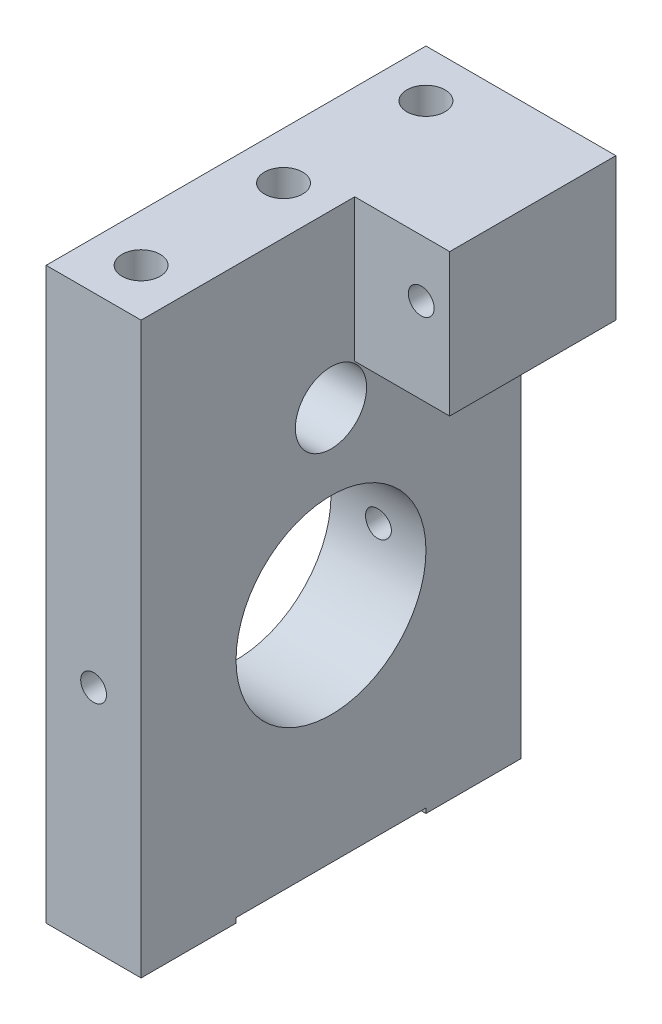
ISO-10303-21;
HEADER;
FILE_DESCRIPTION(('STEP AP214'),'2;1');
FILE_NAME('part.step','',(''),(''),'','','');
FILE_SCHEMA(('AUTOMOTIVE_DESIGN { 1 0 10303 214 1 1 1 1 }'));
ENDSEC;
DATA;
#1=APPLICATION_CONTEXT('core data for automotive mechanical design processes');
#2=APPLICATION_PROTOCOL_DEFINITION('international standard','automotive_design',2000,#1);
#3=PRODUCT_CONTEXT('',#1,'mechanical');
#4=PRODUCT('Part','Part','',(#3));
#5=PRODUCT_RELATED_PRODUCT_CATEGORY('part','',(#4));
#6=PRODUCT_DEFINITION_FORMATION('','',#4);
#7=PRODUCT_DEFINITION_CONTEXT('part definition',#1,'design');
#8=PRODUCT_DEFINITION('design','',#6,#7);
#9=PRODUCT_DEFINITION_SHAPE('','',#8);
#10=(LENGTH_UNIT() NAMED_UNIT(*) SI_UNIT(.MILLI.,.METRE.));
#11=(NAMED_UNIT(*) PLANE_ANGLE_UNIT() SI_UNIT($,.RADIAN.));
#12=(NAMED_UNIT(*) SI_UNIT($,.STERADIAN.) SOLID_ANGLE_UNIT());
#13=UNCERTAINTY_MEASURE_WITH_UNIT(LENGTH_MEASURE(1.E-05),#10,'distance_accuracy_value','');
#14=(GEOMETRIC_REPRESENTATION_CONTEXT(3) GLOBAL_UNCERTAINTY_ASSIGNED_CONTEXT((#13)) GLOBAL_UNIT_ASSIGNED_CONTEXT((#10,
#11,#12)) REPRESENTATION_CONTEXT('',''));
#15=CARTESIAN_POINT('',(0.,0.,0.));
#16=DIRECTION('',(0.,0.,1.));
#17=DIRECTION('',(1.,0.,0.));
#18=AXIS2_PLACEMENT_3D('',#15,#16,#17);
#19=CARTESIAN_POINT('',(6.35,-38.1,25.4));
#20=DIRECTION('',(0.,1.,0.));
#21=DIRECTION('',(0.,0.,1.));
#22=AXIS2_PLACEMENT_3D('',#19,#20,#21);
#23=PLANE('',#22);
#24=CARTESIAN_POINT('',(0.,-38.1,19.05));
#25=DIRECTION('',(0.,-1.,0.));
#26=DIRECTION('',(0.,0.,-1.));
#27=AXIS2_PLACEMENT_3D('',#24,#25,#26);
#28=CIRCLE('',#27,2.5527);
#29=CARTESIAN_POINT('',(0.,-38.1,16.4973));
#30=VERTEX_POINT('',#29);
#31=EDGE_CURVE('E180',#30,#30,#28,.T.);
#32=ORIENTED_EDGE('',*,*,#31,.F.);
#33=EDGE_LOOP('',(#32));
#34=FACE_BOUND('',#33,.T.);
#35=DIRECTION('',(0.,0.,-1.));
#36=VECTOR('',#35,1.);
#37=CARTESIAN_POINT('',(-6.35,-38.1,25.4));
#38=LINE('',#37,#36);
#39=CARTESIAN_POINT('',(-6.35,-38.1,25.4));
#40=VERTEX_POINT('',#39);
#41=CARTESIAN_POINT('',(-6.35,-38.1,12.7));
#42=VERTEX_POINT('',#41);
#43=EDGE_CURVE('E340',#40,#42,#38,.T.);
#44=ORIENTED_EDGE('',*,*,#43,.T.);
#45=DIRECTION('',(1.,0.,0.));
#46=VECTOR('',#45,1.);
#47=CARTESIAN_POINT('',(-6.351,-38.1,12.7));
#48=LINE('',#47,#46);
#49=CARTESIAN_POINT('',(6.35,-38.1,12.7));
#50=VERTEX_POINT('',#49);
#51=EDGE_CURVE('E177',#42,#50,#48,.T.);
#52=ORIENTED_EDGE('',*,*,#51,.T.);
#53=DIRECTION('',(0.,0.,-1.));
#54=VECTOR('',#53,1.);
#55=CARTESIAN_POINT('',(6.35,-38.1,25.4));
#56=LINE('',#55,#54);
#57=CARTESIAN_POINT('',(6.35,-38.1,25.4));
#58=VERTEX_POINT('',#57);
#59=EDGE_CURVE('E290',#58,#50,#56,.T.);
#60=ORIENTED_EDGE('',*,*,#59,.F.);
#61=DIRECTION('',(-1.,0.,0.));
#62=VECTOR('',#61,1.);
#63=CARTESIAN_POINT('',(6.35,-38.1,25.4));
#64=LINE('',#63,#62);
#65=EDGE_CURVE('E11',#58,#40,#64,.T.);
#66=ORIENTED_EDGE('',*,*,#65,.T.);
#67=EDGE_LOOP('',(#44,#52,#60,#66));
#68=FACE_BOUND('',#67,.T.);
#69=ADVANCED_FACE('F38',(#34,#68),#23,.F.);
#70=CARTESIAN_POINT('',(6.35,38.1,25.4));
#71=DIRECTION('',(0.,0.,-1.));
#72=DIRECTION('',(0.,1.,0.));
#73=AXIS2_PLACEMENT_3D('',#70,#71,#72);
#74=PLANE('',#73);
#75=CARTESIAN_POINT('',(0.,-7.62000000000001,25.4));
#76=DIRECTION('',(0.,0.,1.));
#77=DIRECTION('',(1.,0.,0.));
#78=AXIS2_PLACEMENT_3D('',#75,#76,#77);
#79=CIRCLE('',#78,1.72719999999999);
#80=CARTESIAN_POINT('',(1.72719999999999,-7.62000000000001,25.4));
#81=VERTEX_POINT('',#80);
#82=EDGE_CURVE('E609',#81,#81,#79,.T.);
#83=ORIENTED_EDGE('',*,*,#82,.F.);
#84=EDGE_LOOP('',(#83));
#85=FACE_BOUND('',#84,.T.);
#86=DIRECTION('',(0.,-1.,0.));
#87=VECTOR('',#86,1.);
#88=CARTESIAN_POINT('',(-6.35,38.1,25.4));
#89=LINE('',#88,#87);
#90=CARTESIAN_POINT('',(-6.35,38.1,25.4));
#91=VERTEX_POINT('',#90);
#92=EDGE_CURVE('E312',#91,#40,#89,.T.);
#93=ORIENTED_EDGE('',*,*,#92,.T.);
#94=ORIENTED_EDGE('',*,*,#65,.F.);
#95=DIRECTION('',(0.,-1.,0.));
#96=VECTOR('',#95,1.);
#97=CARTESIAN_POINT('',(6.35,38.1,25.4));
#98=LINE('',#97,#96);
#99=CARTESIAN_POINT('',(6.35,38.1,25.4));
#100=VERTEX_POINT('',#99);
#101=EDGE_CURVE('E291',#100,#58,#98,.T.);
#102=ORIENTED_EDGE('',*,*,#101,.F.);
#103=DIRECTION('',(-1.,0.,0.));
#104=VECTOR('',#103,1.);
#105=CARTESIAN_POINT('',(6.35,38.1,25.4));
#106=LINE('',#105,#104);
#107=EDGE_CURVE('E307',#100,#91,#106,.T.);
#108=ORIENTED_EDGE('',*,*,#107,.T.);
#109=EDGE_LOOP('',(#93,#94,#102,#108));
#110=FACE_BOUND('',#109,.T.);
#111=ADVANCED_FACE('F40',(#85,#110),#74,.F.);
#112=CARTESIAN_POINT('',(0.,-38.1,-19.05));
#113=DIRECTION('',(0.,-1.,0.));
#114=DIRECTION('',(0.,0.,-1.));
#115=AXIS2_PLACEMENT_3D('',#112,#113,#114);
#116=CIRCLE('',#115,2.5527);
#117=CARTESIAN_POINT('',(0.,-38.1,-21.6027));
#118=VERTEX_POINT('',#117);
#119=EDGE_CURVE('E192',#118,#118,#116,.T.);
#120=ORIENTED_EDGE('',*,*,#119,.F.);
#121=EDGE_LOOP('',(#120));
#122=FACE_BOUND('',#121,.T.);
#123=CARTESIAN_POINT('',(6.35,-38.1,-12.7));
#124=VERTEX_POINT('',#123);
#125=CARTESIAN_POINT('',(6.35,-38.1,-25.4));
#126=VERTEX_POINT('',#125);
#127=EDGE_CURVE('E285',#124,#126,#56,.T.);
#128=ORIENTED_EDGE('',*,*,#127,.F.);
#129=DIRECTION('',(1.,0.,0.));
#130=VECTOR('',#129,1.);
#131=CARTESIAN_POINT('',(-6.351,-38.1,-12.7));
#132=LINE('',#131,#130);
#133=CARTESIAN_POINT('',(-6.35,-38.1,-12.7));
#134=VERTEX_POINT('',#133);
#135=EDGE_CURVE('E183',#134,#124,#132,.T.);
#136=ORIENTED_EDGE('',*,*,#135,.F.);
#137=CARTESIAN_POINT('',(-6.35,-38.1,-25.4));
#138=VERTEX_POINT('',#137);
#139=EDGE_CURVE('E317',#134,#138,#38,.T.);
#140=ORIENTED_EDGE('',*,*,#139,.T.);
#141=DIRECTION('',(-1.,0.,0.));
#142=VECTOR('',#141,1.);
#143=CARTESIAN_POINT('',(6.35,-38.1,-25.4));
#144=LINE('',#143,#142);
#145=EDGE_CURVE('E51',#126,#138,#144,.T.);
#146=ORIENTED_EDGE('',*,*,#145,.F.);
#147=EDGE_LOOP('',(#128,#136,#140,#146));
#148=FACE_BOUND('',#147,.T.);
#149=ADVANCED_FACE('F264',(#122,#148),#23,.F.);
#150=CARTESIAN_POINT('',(6.35,38.1,-25.4));
#151=DIRECTION('',(0.,0.,1.));
#152=DIRECTION('',(0.,-1.,0.));
#153=AXIS2_PLACEMENT_3D('',#150,#151,#152);
#154=PLANE('',#153);
#155=CARTESIAN_POINT('',(0.,-7.62000000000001,-25.4));
#156=DIRECTION('',(0.,0.,1.));
#157=DIRECTION('',(0.,-1.,0.));
#158=AXIS2_PLACEMENT_3D('',#155,#156,#157);
#159=CIRCLE('',#158,1.72719999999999);
#160=CARTESIAN_POINT('',(0.,-9.3472,-25.4));
#161=VERTEX_POINT('',#160);
#162=EDGE_CURVE('E604',#161,#161,#159,.T.);
#163=ORIENTED_EDGE('',*,*,#162,.T.);
#164=EDGE_LOOP('',(#163));
#165=FACE_BOUND('',#164,.T.);
#166=CARTESIAN_POINT('',(15.24,30.48,-25.4));
#167=DIRECTION('',(0.,0.,1.));
#168=DIRECTION('',(0.,-1.,0.));
#169=AXIS2_PLACEMENT_3D('',#166,#167,#168);
#170=CIRCLE('',#169,1.72719999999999);
#171=CARTESIAN_POINT('',(15.24,28.7528,-25.4));
#172=VERTEX_POINT('',#171);
#173=EDGE_CURVE('E223',#172,#172,#170,.T.);
#174=ORIENTED_EDGE('',*,*,#173,.T.);
#175=EDGE_LOOP('',(#174));
#176=FACE_BOUND('',#175,.T.);
#177=DIRECTION('',(0.,1.,0.));
#178=VECTOR('',#177,1.);
#179=CARTESIAN_POINT('',(-6.35,38.1,-25.4));
#180=LINE('',#179,#178);
#181=CARTESIAN_POINT('',(-6.35,38.1,-25.4));
#182=VERTEX_POINT('',#181);
#183=EDGE_CURVE('E628',#138,#182,#180,.T.);
#184=ORIENTED_EDGE('',*,*,#183,.T.);
#185=DIRECTION('',(-1.,0.,0.));
#186=VECTOR('',#185,1.);
#187=CARTESIAN_POINT('',(6.35,38.1,-25.4));
#188=LINE('',#187,#186);
#189=CARTESIAN_POINT('',(19.05,38.1,-25.4));
#190=VERTEX_POINT('',#189);
#191=EDGE_CURVE('E629',#190,#182,#188,.T.);
#192=ORIENTED_EDGE('',*,*,#191,.F.);
#193=DIRECTION('',(0.,1.,0.));
#194=VECTOR('',#193,1.);
#195=CARTESIAN_POINT('',(19.05,38.1,-25.4));
#196=LINE('',#195,#194);
#197=CARTESIAN_POINT('',(19.05,19.05,-25.4));
#198=VERTEX_POINT('',#197);
#199=EDGE_CURVE('E198',#198,#190,#196,.T.);
#200=ORIENTED_EDGE('',*,*,#199,.F.);
#201=DIRECTION('',(-1.,0.,0.));
#202=VECTOR('',#201,1.);
#203=CARTESIAN_POINT('',(19.05,19.05,-25.4));
#204=LINE('',#203,#202);
#205=CARTESIAN_POINT('',(6.35,19.05,-25.4));
#206=VERTEX_POINT('',#205);
#207=EDGE_CURVE('E208',#198,#206,#204,.T.);
#208=ORIENTED_EDGE('',*,*,#207,.T.);
#209=DIRECTION('',(0.,1.,0.));
#210=VECTOR('',#209,1.);
#211=CARTESIAN_POINT('',(6.35,38.1,-25.4));
#212=LINE('',#211,#210);
#213=EDGE_CURVE('E294',#126,#206,#212,.T.);
#214=ORIENTED_EDGE('',*,*,#213,.F.);
#215=ORIENTED_EDGE('',*,*,#145,.T.);
#216=EDGE_LOOP('',(#184,#192,#200,#208,#214,#215));
#217=FACE_BOUND('',#216,.T.);
#218=ADVANCED_FACE('F273',(#165,#176,#217),#154,.F.);
#219=CARTESIAN_POINT('',(6.35,38.1,25.4));
#220=DIRECTION('',(0.,-1.,0.));
#221=DIRECTION('',(0.,0.,-1.));
#222=AXIS2_PLACEMENT_3D('',#219,#220,#221);
#223=PLANE('',#222);
#224=CARTESIAN_POINT('',(0.,38.1,-19.05));
#225=DIRECTION('',(0.,1.,0.));
#226=DIRECTION('',(0.,0.,1.));
#227=AXIS2_PLACEMENT_3D('',#224,#225,#226);
#228=CIRCLE('',#227,2.55269999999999);
#229=CARTESIAN_POINT('',(0.,38.1,-16.4973));
#230=VERTEX_POINT('',#229);
#231=EDGE_CURVE('E148',#230,#230,#228,.T.);
#232=ORIENTED_EDGE('',*,*,#231,.F.);
#233=EDGE_LOOP('',(#232));
#234=FACE_BOUND('',#233,.T.);
#235=CARTESIAN_POINT('',(0.,38.1,0.));
#236=DIRECTION('',(0.,1.,0.));
#237=DIRECTION('',(0.,0.,1.));
#238=AXIS2_PLACEMENT_3D('',#235,#236,#237);
#239=CIRCLE('',#238,2.55269999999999);
#240=CARTESIAN_POINT('',(0.,38.1,2.55269999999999));
#241=VERTEX_POINT('',#240);
#242=EDGE_CURVE('E147',#241,#241,#239,.T.);
#243=ORIENTED_EDGE('',*,*,#242,.F.);
#244=EDGE_LOOP('',(#243));
#245=FACE_BOUND('',#244,.T.);
#246=CARTESIAN_POINT('',(0.,38.1,19.05));
#247=DIRECTION('',(0.,1.,0.));
#248=DIRECTION('',(0.,0.,1.));
#249=AXIS2_PLACEMENT_3D('',#246,#247,#248);
#250=CIRCLE('',#249,2.55269999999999);
#251=CARTESIAN_POINT('',(0.,38.1,21.6027));
#252=VERTEX_POINT('',#251);
#253=EDGE_CURVE('E151',#252,#252,#250,.T.);
#254=ORIENTED_EDGE('',*,*,#253,.F.);
#255=EDGE_LOOP('',(#254));
#256=FACE_BOUND('',#255,.T.);
#257=DIRECTION('',(0.,0.,1.));
#258=VECTOR('',#257,1.);
#259=CARTESIAN_POINT('',(-6.35,38.1,25.4));
#260=LINE('',#259,#258);
#261=EDGE_CURVE('E296',#182,#91,#260,.T.);
#262=ORIENTED_EDGE('',*,*,#261,.T.);
#263=ORIENTED_EDGE('',*,*,#107,.F.);
#264=DIRECTION('',(0.,0.,1.));
#265=VECTOR('',#264,1.);
#266=CARTESIAN_POINT('',(6.35,38.1,25.4));
#267=LINE('',#266,#265);
#268=CARTESIAN_POINT('',(6.35,38.1,-3.17499999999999));
#269=VERTEX_POINT('',#268);
#270=EDGE_CURVE('E304',#269,#100,#267,.T.);
#271=ORIENTED_EDGE('',*,*,#270,.F.);
#272=DIRECTION('',(-1.,0.,0.));
#273=VECTOR('',#272,1.);
#274=CARTESIAN_POINT('',(19.05,38.1,-3.17499999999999));
#275=LINE('',#274,#273);
#276=CARTESIAN_POINT('',(19.05,38.1,-3.17499999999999));
#277=VERTEX_POINT('',#276);
#278=EDGE_CURVE('E310',#277,#269,#275,.T.);
#279=ORIENTED_EDGE('',*,*,#278,.F.);
#280=DIRECTION('',(0.,0.,1.));
#281=VECTOR('',#280,1.);
#282=CARTESIAN_POINT('',(19.05,38.1,-25.4));
#283=LINE('',#282,#281);
#284=EDGE_CURVE('E201',#190,#277,#283,.T.);
#285=ORIENTED_EDGE('',*,*,#284,.F.);
#286=ORIENTED_EDGE('',*,*,#191,.T.);
#287=EDGE_LOOP('',(#262,#263,#271,#279,#285,#286));
#288=FACE_BOUND('',#287,.T.);
#289=ADVANCED_FACE('F278',(#234,#245,#256,#288),#223,.F.);
#290=CARTESIAN_POINT('',(6.35,0.,0.));
#291=DIRECTION('',(1.,0.,0.));
#292=DIRECTION('',(0.,0.,-1.));
#293=AXIS2_PLACEMENT_3D('',#290,#291,#292);
#294=PLANE('',#293);
#295=CARTESIAN_POINT('',(6.35,15.24,0.));
#296=DIRECTION('',(1.,0.,0.));
#297=DIRECTION('',(0.,0.,-1.));
#298=AXIS2_PLACEMENT_3D('',#295,#296,#297);
#299=CIRCLE('',#298,4.7625);
#300=CARTESIAN_POINT('',(6.35,15.24,-4.7625));
#301=VERTEX_POINT('',#300);
#302=EDGE_CURVE('E234',#301,#301,#299,.T.);
#303=ORIENTED_EDGE('',*,*,#302,.F.);
#304=EDGE_LOOP('',(#303));
#305=FACE_BOUND('',#304,.T.);
#306=CARTESIAN_POINT('',(6.35,-7.62000000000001,0.));
#307=DIRECTION('',(1.,0.,0.));
#308=DIRECTION('',(0.,0.,-1.));
#309=AXIS2_PLACEMENT_3D('',#306,#307,#308);
#310=CIRCLE('',#309,12.7);
#311=CARTESIAN_POINT('',(6.35,-7.62000000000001,-12.7));
#312=VERTEX_POINT('',#311);
#313=EDGE_CURVE('E226',#312,#312,#310,.T.);
#314=ORIENTED_EDGE('',*,*,#313,.F.);
#315=EDGE_LOOP('',(#314));
#316=FACE_BOUND('',#315,.T.);
#317=DIRECTION('',(0.,-1.,0.));
#318=VECTOR('',#317,1.);
#319=CARTESIAN_POINT('',(6.35,-38.1,12.7));
#320=LINE('',#319,#318);
#321=CARTESIAN_POINT('',(6.35,-37.465,12.7));
#322=VERTEX_POINT('',#321);
#323=EDGE_CURVE('E169',#322,#50,#320,.T.);
#324=ORIENTED_EDGE('',*,*,#323,.F.);
#325=DIRECTION('',(0.,0.,1.));
#326=VECTOR('',#325,1.);
#327=CARTESIAN_POINT('',(6.35,-37.465,12.7));
#328=LINE('',#327,#326);
#329=CARTESIAN_POINT('',(6.35,-37.465,-12.7));
#330=VERTEX_POINT('',#329);
#331=EDGE_CURVE('E174',#330,#322,#328,.T.);
#332=ORIENTED_EDGE('',*,*,#331,.F.);
#333=DIRECTION('',(0.,1.,0.));
#334=VECTOR('',#333,1.);
#335=CARTESIAN_POINT('',(6.35,-38.1,-12.7));
#336=LINE('',#335,#334);
#337=EDGE_CURVE('E171',#124,#330,#336,.T.);
#338=ORIENTED_EDGE('',*,*,#337,.F.);
#339=ORIENTED_EDGE('',*,*,#127,.T.);
#340=ORIENTED_EDGE('',*,*,#213,.T.);
#341=DIRECTION('',(0.,0.,-1.));
#342=VECTOR('',#341,1.);
#343=CARTESIAN_POINT('',(6.35,19.05,-25.4));
#344=LINE('',#343,#342);
#345=CARTESIAN_POINT('',(6.35,19.05,-3.175));
#346=VERTEX_POINT('',#345);
#347=EDGE_CURVE('E202',#346,#206,#344,.T.);
#348=ORIENTED_EDGE('',*,*,#347,.F.);
#349=DIRECTION('',(0.,-1.,0.));
#350=VECTOR('',#349,1.);
#351=CARTESIAN_POINT('',(6.35,38.1,-3.17499999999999));
#352=LINE('',#351,#350);
#353=EDGE_CURVE('E67',#269,#346,#352,.T.);
#354=ORIENTED_EDGE('',*,*,#353,.F.);
#355=ORIENTED_EDGE('',*,*,#270,.T.);
#356=ORIENTED_EDGE('',*,*,#101,.T.);
#357=ORIENTED_EDGE('',*,*,#59,.T.);
#358=EDGE_LOOP('',(#324,#332,#338,#339,#340,#348,#354,#355,#356,#357));
#359=FACE_BOUND('',#358,.T.);
#360=ADVANCED_FACE('F335',(#305,#316,#359),#294,.T.);
#361=CARTESIAN_POINT('',(-6.35,0.,0.));
#362=DIRECTION('',(1.,0.,0.));
#363=DIRECTION('',(0.,0.,-1.));
#364=AXIS2_PLACEMENT_3D('',#361,#362,#363);
#365=PLANE('',#364);
#366=CARTESIAN_POINT('',(-6.35,15.24,0.));
#367=DIRECTION('',(-1.,0.,0.));
#368=DIRECTION('',(0.,0.,1.));
#369=AXIS2_PLACEMENT_3D('',#366,#367,#368);
#370=CIRCLE('',#369,4.7625);
#371=CARTESIAN_POINT('',(-6.35,15.24,4.7625));
#372=VERTEX_POINT('',#371);
#373=EDGE_CURVE('E235',#372,#372,#370,.T.);
#374=ORIENTED_EDGE('',*,*,#373,.F.);
#375=EDGE_LOOP('',(#374));
#376=FACE_BOUND('',#375,.T.);
#377=CARTESIAN_POINT('',(-6.35,-7.62000000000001,0.));
#378=DIRECTION('',(1.,0.,0.));
#379=DIRECTION('',(0.,0.,-1.));
#380=AXIS2_PLACEMENT_3D('',#377,#378,#379);
#381=CIRCLE('',#380,12.7);
#382=CARTESIAN_POINT('',(-6.35,-7.62000000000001,-12.7));
#383=VERTEX_POINT('',#382);
#384=EDGE_CURVE('E154',#383,#383,#381,.F.);
#385=ORIENTED_EDGE('',*,*,#384,.F.);
#386=EDGE_LOOP('',(#385));
#387=FACE_BOUND('',#386,.T.);
#388=DIRECTION('',(0.,0.,-1.));
#389=VECTOR('',#388,1.);
#390=CARTESIAN_POINT('',(-6.35,-37.465,12.7));
#391=LINE('',#390,#389);
#392=CARTESIAN_POINT('',(-6.35,-37.465,12.7));
#393=VERTEX_POINT('',#392);
#394=CARTESIAN_POINT('',(-6.35,-37.465,-12.7));
#395=VERTEX_POINT('',#394);
#396=EDGE_CURVE('E59',#393,#395,#391,.T.);
#397=ORIENTED_EDGE('',*,*,#396,.F.);
#398=DIRECTION('',(0.,1.,0.));
#399=VECTOR('',#398,1.);
#400=CARTESIAN_POINT('',(-6.35,-38.1,12.7));
#401=LINE('',#400,#399);
#402=EDGE_CURVE('E166',#42,#393,#401,.T.);
#403=ORIENTED_EDGE('',*,*,#402,.F.);
#404=ORIENTED_EDGE('',*,*,#43,.F.);
#405=ORIENTED_EDGE('',*,*,#92,.F.);
#406=ORIENTED_EDGE('',*,*,#261,.F.);
#407=ORIENTED_EDGE('',*,*,#183,.F.);
#408=ORIENTED_EDGE('',*,*,#139,.F.);
#409=DIRECTION('',(0.,-1.,0.));
#410=VECTOR('',#409,1.);
#411=CARTESIAN_POINT('',(-6.35,-38.1,-12.7));
#412=LINE('',#411,#410);
#413=EDGE_CURVE('E163',#395,#134,#412,.T.);
#414=ORIENTED_EDGE('',*,*,#413,.F.);
#415=EDGE_LOOP('',(#397,#403,#404,#405,#406,#407,#408,#414));
#416=FACE_BOUND('',#415,.T.);
#417=ADVANCED_FACE('F345',(#376,#387,#416),#365,.F.);
#418=CARTESIAN_POINT('',(19.05,38.1,-3.17499999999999));
#419=DIRECTION('',(0.,0.,-1.));
#420=DIRECTION('',(0.,1.,0.));
#421=AXIS2_PLACEMENT_3D('',#418,#419,#420);
#422=PLANE('',#421);
#423=CARTESIAN_POINT('',(15.24,30.48,-3.175));
#424=DIRECTION('',(0.,0.,1.));
#425=DIRECTION('',(1.,0.,0.));
#426=AXIS2_PLACEMENT_3D('',#423,#424,#425);
#427=CIRCLE('',#426,1.72719999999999);
#428=CARTESIAN_POINT('',(16.9672,30.48,-3.175));
#429=VERTEX_POINT('',#428);
#430=EDGE_CURVE('E227',#429,#429,#427,.T.);
#431=ORIENTED_EDGE('',*,*,#430,.F.);
#432=EDGE_LOOP('',(#431));
#433=FACE_BOUND('',#432,.T.);
#434=ORIENTED_EDGE('',*,*,#353,.T.);
#435=DIRECTION('',(-1.,0.,0.));
#436=VECTOR('',#435,1.);
#437=CARTESIAN_POINT('',(19.05,19.05,-3.175));
#438=LINE('',#437,#436);
#439=CARTESIAN_POINT('',(19.05,19.05,-3.175));
#440=VERTEX_POINT('',#439);
#441=EDGE_CURVE('E211',#440,#346,#438,.T.);
#442=ORIENTED_EDGE('',*,*,#441,.F.);
#443=DIRECTION('',(0.,-1.,0.));
#444=VECTOR('',#443,1.);
#445=CARTESIAN_POINT('',(19.05,38.1,-3.17499999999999));
#446=LINE('',#445,#444);
#447=EDGE_CURVE('E204',#277,#440,#446,.T.);
#448=ORIENTED_EDGE('',*,*,#447,.F.);
#449=ORIENTED_EDGE('',*,*,#278,.T.);
#450=EDGE_LOOP('',(#434,#442,#448,#449));
#451=FACE_BOUND('',#450,.T.);
#452=ADVANCED_FACE('F324',(#433,#451),#422,.F.);
#453=CARTESIAN_POINT('',(19.05,19.05,-25.4));
#454=DIRECTION('',(0.,1.,0.));
#455=DIRECTION('',(0.,0.,1.));
#456=AXIS2_PLACEMENT_3D('',#453,#454,#455);
#457=PLANE('',#456);
#458=ORIENTED_EDGE('',*,*,#347,.T.);
#459=ORIENTED_EDGE('',*,*,#207,.F.);
#460=DIRECTION('',(0.,0.,-1.));
#461=VECTOR('',#460,1.);
#462=CARTESIAN_POINT('',(19.05,19.05,-25.4));
#463=LINE('',#462,#461);
#464=EDGE_CURVE('E206',#440,#198,#463,.T.);
#465=ORIENTED_EDGE('',*,*,#464,.F.);
#466=ORIENTED_EDGE('',*,*,#441,.T.);
#467=EDGE_LOOP('',(#458,#459,#465,#466));
#468=FACE_BOUND('',#467,.T.);
#469=ADVANCED_FACE('F322',(#468),#457,.F.);
#470=CARTESIAN_POINT('',(19.05,0.,0.));
#471=DIRECTION('',(-1.,0.,0.));
#472=DIRECTION('',(0.,0.,1.));
#473=AXIS2_PLACEMENT_3D('',#470,#471,#472);
#474=PLANE('',#473);
#475=ORIENTED_EDGE('',*,*,#199,.T.);
#476=ORIENTED_EDGE('',*,*,#284,.T.);
#477=ORIENTED_EDGE('',*,*,#447,.T.);
#478=ORIENTED_EDGE('',*,*,#464,.T.);
#479=EDGE_LOOP('',(#475,#476,#477,#478));
#480=FACE_BOUND('',#479,.T.);
#481=ADVANCED_FACE('F326',(#480),#474,.F.);
#482=CARTESIAN_POINT('',(0.,-19.05,-19.05));
#483=DIRECTION('',(0.,-1.,0.));
#484=DIRECTION('',(0.,0.,-1.));
#485=AXIS2_PLACEMENT_3D('',#482,#483,#484);
#486=CONICAL_SURFACE('',#485,2.5527,1.02974425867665);
#487=CARTESIAN_POINT('',(0.,-17.5161830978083,-19.05));
#488=VERTEX_POINT('',#487);
#489=VERTEX_LOOP('',#488);
#490=FACE_BOUND('',#489,.T.);
#491=CARTESIAN_POINT('',(0.,-19.05,-19.05));
#492=DIRECTION('',(0.,-1.,0.));
#493=DIRECTION('',(0.,0.,-1.));
#494=AXIS2_PLACEMENT_3D('',#491,#492,#493);
#495=CIRCLE('',#494,2.5527);
#496=CARTESIAN_POINT('',(0.,-19.05,-21.6027));
#497=VERTEX_POINT('',#496);
#498=EDGE_CURVE('E195',#497,#497,#495,.T.);
#499=ORIENTED_EDGE('',*,*,#498,.T.);
#500=EDGE_LOOP('',(#499));
#501=FACE_BOUND('',#500,.T.);
#502=ADVANCED_FACE('F374',(#490,#501),#486,.F.);
#503=CARTESIAN_POINT('',(0.,-38.1,-19.05));
#504=DIRECTION('',(0.,-1.,0.));
#505=DIRECTION('',(0.,0.,-1.));
#506=AXIS2_PLACEMENT_3D('',#503,#504,#505);
#507=CYLINDRICAL_SURFACE('',#506,2.5527);
#508=ORIENTED_EDGE('',*,*,#498,.F.);
#509=EDGE_LOOP('',(#508));
#510=FACE_BOUND('',#509,.T.);
#511=ORIENTED_EDGE('',*,*,#119,.T.);
#512=EDGE_LOOP('',(#511));
#513=FACE_BOUND('',#512,.T.);
#514=ADVANCED_FACE('F370',(#510,#513),#507,.F.);
#515=CARTESIAN_POINT('',(0.,-19.05,19.05));
#516=DIRECTION('',(0.,-1.,0.));
#517=DIRECTION('',(0.,0.,-1.));
#518=AXIS2_PLACEMENT_3D('',#515,#516,#517);
#519=CONICAL_SURFACE('',#518,2.5527,1.02974425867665);
#520=CARTESIAN_POINT('',(0.,-17.5161830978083,19.05));
#521=VERTEX_POINT('',#520);
#522=VERTEX_LOOP('',#521);
#523=FACE_BOUND('',#522,.T.);
#524=CARTESIAN_POINT('',(0.,-19.05,19.05));
#525=DIRECTION('',(0.,-1.,0.));
#526=DIRECTION('',(0.,0.,-1.));
#527=AXIS2_PLACEMENT_3D('',#524,#525,#526);
#528=CIRCLE('',#527,2.5527);
#529=CARTESIAN_POINT('',(0.,-19.05,16.4973));
#530=VERTEX_POINT('',#529);
#531=EDGE_CURVE('E189',#530,#530,#528,.T.);
#532=ORIENTED_EDGE('',*,*,#531,.T.);
#533=EDGE_LOOP('',(#532));
#534=FACE_BOUND('',#533,.T.);
#535=ADVANCED_FACE('F366',(#523,#534),#519,.F.);
#536=CARTESIAN_POINT('',(0.,-38.1,19.05));
#537=DIRECTION('',(0.,-1.,0.));
#538=DIRECTION('',(0.,0.,-1.));
#539=AXIS2_PLACEMENT_3D('',#536,#537,#538);
#540=CYLINDRICAL_SURFACE('',#539,2.5527);
#541=ORIENTED_EDGE('',*,*,#531,.F.);
#542=EDGE_LOOP('',(#541));
#543=FACE_BOUND('',#542,.T.);
#544=ORIENTED_EDGE('',*,*,#31,.T.);
#545=EDGE_LOOP('',(#544));
#546=FACE_BOUND('',#545,.T.);
#547=ADVANCED_FACE('F360',(#543,#546),#540,.F.);
#548=CARTESIAN_POINT('',(-6.351,-38.1,12.7));
#549=DIRECTION('',(0.,0.,1.));
#550=DIRECTION('',(1.,0.,0.));
#551=AXIS2_PLACEMENT_3D('',#548,#549,#550);
#552=PLANE('',#551);
#553=ORIENTED_EDGE('',*,*,#402,.T.);
#554=DIRECTION('',(1.,0.,0.));
#555=VECTOR('',#554,1.);
#556=CARTESIAN_POINT('',(-6.351,-37.465,12.7));
#557=LINE('',#556,#555);
#558=EDGE_CURVE('E178',#393,#322,#557,.T.);
#559=ORIENTED_EDGE('',*,*,#558,.T.);
#560=ORIENTED_EDGE('',*,*,#323,.T.);
#561=ORIENTED_EDGE('',*,*,#51,.F.);
#562=EDGE_LOOP('',(#553,#559,#560,#561));
#563=FACE_BOUND('',#562,.T.);
#564=ADVANCED_FACE('F343',(#563),#552,.F.);
#565=CARTESIAN_POINT('',(-6.351,-37.465,12.7));
#566=DIRECTION('',(0.,1.,0.));
#567=DIRECTION('',(0.,0.,1.));
#568=AXIS2_PLACEMENT_3D('',#565,#566,#567);
#569=PLANE('',#568);
#570=ORIENTED_EDGE('',*,*,#396,.T.);
#571=DIRECTION('',(1.,0.,0.));
#572=VECTOR('',#571,1.);
#573=CARTESIAN_POINT('',(-6.351,-37.465,-12.7));
#574=LINE('',#573,#572);
#575=EDGE_CURVE('E181',#395,#330,#574,.T.);
#576=ORIENTED_EDGE('',*,*,#575,.T.);
#577=ORIENTED_EDGE('',*,*,#331,.T.);
#578=ORIENTED_EDGE('',*,*,#558,.F.);
#579=EDGE_LOOP('',(#570,#576,#577,#578));
#580=FACE_BOUND('',#579,.T.);
#581=ADVANCED_FACE('F351',(#580),#569,.F.);
#582=CARTESIAN_POINT('',(-6.351,-38.1,-12.7));
#583=DIRECTION('',(0.,0.,-1.));
#584=DIRECTION('',(-1.,0.,0.));
#585=AXIS2_PLACEMENT_3D('',#582,#583,#584);
#586=PLANE('',#585);
#587=ORIENTED_EDGE('',*,*,#413,.T.);
#588=ORIENTED_EDGE('',*,*,#135,.T.);
#589=ORIENTED_EDGE('',*,*,#337,.T.);
#590=ORIENTED_EDGE('',*,*,#575,.F.);
#591=EDGE_LOOP('',(#587,#588,#589,#590));
#592=FACE_BOUND('',#591,.T.);
#593=ADVANCED_FACE('F349',(#592),#586,.F.);
#594=CARTESIAN_POINT('',(0.,19.05,19.05));
#595=DIRECTION('',(0.,1.,0.));
#596=DIRECTION('',(0.,0.,1.));
#597=AXIS2_PLACEMENT_3D('',#594,#595,#596);
#598=CONICAL_SURFACE('',#597,2.55269999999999,1.02974425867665);
#599=CARTESIAN_POINT('',(0.,17.5161830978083,19.05));
#600=VERTEX_POINT('',#599);
#601=VERTEX_LOOP('',#600);
#602=FACE_BOUND('',#601,.T.);
#603=CARTESIAN_POINT('',(0.,19.05,19.05));
#604=DIRECTION('',(0.,1.,0.));
#605=DIRECTION('',(0.,0.,1.));
#606=AXIS2_PLACEMENT_3D('',#603,#604,#605);
#607=CIRCLE('',#606,2.55269999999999);
#608=CARTESIAN_POINT('',(0.,19.05,21.6027));
#609=VERTEX_POINT('',#608);
#610=EDGE_CURVE('E160',#609,#609,#607,.T.);
#611=ORIENTED_EDGE('',*,*,#610,.T.);
#612=EDGE_LOOP('',(#611));
#613=FACE_BOUND('',#612,.T.);
#614=ADVANCED_FACE('F358',(#602,#613),#598,.F.);
#615=CARTESIAN_POINT('',(0.,38.1,19.05));
#616=DIRECTION('',(0.,1.,0.));
#617=DIRECTION('',(0.,0.,1.));
#618=AXIS2_PLACEMENT_3D('',#615,#616,#617);
#619=CYLINDRICAL_SURFACE('',#618,2.55269999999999);
#620=ORIENTED_EDGE('',*,*,#610,.F.);
#621=EDGE_LOOP('',(#620));
#622=FACE_BOUND('',#621,.T.);
#623=ORIENTED_EDGE('',*,*,#253,.T.);
#624=EDGE_LOOP('',(#623));
#625=FACE_BOUND('',#624,.T.);
#626=ADVANCED_FACE('F402',(#622,#625),#619,.F.);
#627=CARTESIAN_POINT('',(0.,38.1,0.));
#628=DIRECTION('',(0.,1.,0.));
#629=DIRECTION('',(0.,0.,1.));
#630=AXIS2_PLACEMENT_3D('',#627,#628,#629);
#631=CYLINDRICAL_SURFACE('',#630,2.55269999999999);
#632=CARTESIAN_POINT('',(0.,19.2605881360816,2.55269999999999));
#633=CARTESIAN_POINT('',(-0.131460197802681,19.2606033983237,2.55268830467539));
#634=CARTESIAN_POINT('',(-0.263056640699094,19.267137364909,2.54247419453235));
#635=CARTESIAN_POINT('',(-0.522081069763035,19.29227824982,2.50219310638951));
#636=CARTESIAN_POINT('',(-0.649501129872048,19.3109068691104,2.47209044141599));
#637=CARTESIAN_POINT('',(-0.89592211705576,19.3574292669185,2.39378837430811));
#638=CARTESIAN_POINT('',(-1.01496829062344,19.3852677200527,2.34569681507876));
#639=CARTESIAN_POINT('',(-1.24326334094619,19.4469850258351,2.23311297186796));
#640=CARTESIAN_POINT('',(-1.35251054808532,19.4808649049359,2.1686179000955));
#641=CARTESIAN_POINT('',(-1.56961252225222,19.5547899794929,2.01784253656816));
#642=CARTESIAN_POINT('',(-1.67633531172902,19.5951149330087,1.93006884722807));
#643=CARTESIAN_POINT('',(-1.87444566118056,19.6751388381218,1.73831821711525));
#644=CARTESIAN_POINT('',(-1.96582451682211,19.7148374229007,1.63433214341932));
#645=CARTESIAN_POINT('',(-2.13786964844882,19.792941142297,1.40292394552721));
#646=CARTESIAN_POINT('',(-2.21708530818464,19.8309860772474,1.27429010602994));
#647=CARTESIAN_POINT('',(-2.35222724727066,19.8977507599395,1.00309699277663));
#648=CARTESIAN_POINT('',(-2.40817038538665,19.9264772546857,0.860547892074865));
#649=CARTESIAN_POINT('',(-2.49049836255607,19.969331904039,0.577611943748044));
#650=CARTESIAN_POINT('',(-2.51888530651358,19.9844418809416,0.437959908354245));
#651=CARTESIAN_POINT('',(-2.55194859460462,20.002075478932,0.15512757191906));
#652=CARTESIAN_POINT('',(-2.55664182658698,20.004608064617,0.0119498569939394));
#653=CARTESIAN_POINT('',(-2.54281759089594,19.9972088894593,-0.258562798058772));
#654=CARTESIAN_POINT('',(-2.52656501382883,19.9884932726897,-0.386055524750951));
#655=CARTESIAN_POINT('',(-2.4754487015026,19.9614938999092,-0.636181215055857));
#656=CARTESIAN_POINT('',(-2.4405835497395,19.9432094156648,-0.758813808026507));
#657=CARTESIAN_POINT('',(-2.35315944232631,19.8984404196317,-0.997642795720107));
#658=CARTESIAN_POINT('',(-2.30039638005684,19.8718616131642,-1.11374607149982));
#659=CARTESIAN_POINT('',(-2.17903983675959,19.8128037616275,-1.33569475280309));
#660=CARTESIAN_POINT('',(-2.11044108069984,19.7803227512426,-1.44153672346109));
#661=CARTESIAN_POINT('',(-1.95118600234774,19.7084108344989,-1.65175674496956));
#662=CARTESIAN_POINT('',(-1.85897560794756,19.6686084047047,-1.75483156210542));
#663=CARTESIAN_POINT('',(-1.65923910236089,19.5885409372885,-1.94480010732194));
#664=CARTESIAN_POINT('',(-1.5516983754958,19.5482754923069,-2.03167820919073));
#665=CARTESIAN_POINT('',(-1.31373062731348,19.4681835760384,-2.19378524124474));
#666=CARTESIAN_POINT('',(-1.18215765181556,19.4286539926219,-2.26751112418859));
#667=CARTESIAN_POINT('',(-0.975200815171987,19.3766257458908,-2.36029538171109));
#668=CARTESIAN_POINT('',(-0.904602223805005,19.3604917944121,-2.38825943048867));
#669=CARTESIAN_POINT('',(-0.760638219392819,19.3313010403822,-2.43792782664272));
#670=CARTESIAN_POINT('',(-0.687274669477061,19.318242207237,-2.45963630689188));
#671=CARTESIAN_POINT('',(-0.544367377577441,19.2967085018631,-2.49497819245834));
#672=CARTESIAN_POINT('',(-0.474992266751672,19.2879490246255,-2.50912137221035));
#673=CARTESIAN_POINT('',(-0.334993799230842,19.2739191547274,-2.53161584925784));
#674=CARTESIAN_POINT('',(-0.264371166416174,19.2686468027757,-2.53997039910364));
#675=CARTESIAN_POINT('',(-0.122531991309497,19.2618320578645,-2.55074812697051));
#676=CARTESIAN_POINT('',(-0.0513158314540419,19.26028742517,-2.55317486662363));
#677=CARTESIAN_POINT('',(0.0910279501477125,19.2609869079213,-2.55207068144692));
#678=CARTESIAN_POINT('',(0.162155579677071,19.2632306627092,-2.54854032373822));
#679=CARTESIAN_POINT('',(0.355295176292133,19.2744169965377,-2.5308300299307));
#680=CARTESIAN_POINT('',(0.476614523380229,19.2870497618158,-2.51076406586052));
#681=CARTESIAN_POINT('',(0.713775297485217,19.3217597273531,-2.45391933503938));
#682=CARTESIAN_POINT('',(0.829614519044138,19.3438406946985,-2.4171339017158));
#683=CARTESIAN_POINT('',(1.05852207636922,19.3960353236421,-2.32629073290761));
#684=CARTESIAN_POINT('',(1.17124425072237,19.4264596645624,-2.27154425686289));
#685=CARTESIAN_POINT('',(1.38656860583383,19.4917227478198,-2.1469059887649));
#686=CARTESIAN_POINT('',(1.4891656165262,19.5265637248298,-2.0770065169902));
#687=CARTESIAN_POINT('',(1.69734844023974,19.6029568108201,-1.91192497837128));
#688=CARTESIAN_POINT('',(1.80110321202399,19.6447355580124,-1.81452786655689));
#689=CARTESIAN_POINT('',(1.99148369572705,19.7259467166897,-1.6032775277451));
#690=CARTESIAN_POINT('',(2.07810066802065,19.7653779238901,-1.48941595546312));
#691=CARTESIAN_POINT('',(2.23513229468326,19.8395596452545,-1.24209766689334));
#692=CARTESIAN_POINT('',(2.30469163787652,19.8740365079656,-1.10800952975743));
#693=CARTESIAN_POINT('',(2.41953220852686,19.9322064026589,-0.827660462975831));
#694=CARTESIAN_POINT('',(2.46483765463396,19.9559101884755,-0.681411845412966));
#695=CARTESIAN_POINT('',(2.52548519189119,19.9879066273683,-0.39655695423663));
#696=CARTESIAN_POINT('',(2.54335741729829,19.9974966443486,-0.258635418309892));
#697=CARTESIAN_POINT('',(2.55639491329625,20.0044773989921,0.0185617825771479));
#698=CARTESIAN_POINT('',(2.55157085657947,20.0018738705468,0.157836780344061));
#699=CARTESIAN_POINT('',(2.52085224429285,19.9854910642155,0.421609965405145));
#700=CARTESIAN_POINT('',(2.49672703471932,19.9726505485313,0.546379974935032));
#701=CARTESIAN_POINT('',(2.43071300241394,19.9381596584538,0.789825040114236));
#702=CARTESIAN_POINT('',(2.38882195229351,19.9165081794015,0.908499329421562));
#703=CARTESIAN_POINT('',(2.2869613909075,19.8652907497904,1.14142297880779));
#704=CARTESIAN_POINT('',(2.22637746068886,19.8354603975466,1.25534361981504));
#705=CARTESIAN_POINT('',(2.0896095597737,19.7707797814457,1.47180969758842));
#706=CARTESIAN_POINT('',(2.01341892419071,19.7359273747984,1.57435024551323));
#707=CARTESIAN_POINT('',(1.83785169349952,19.6599423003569,1.77721979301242));
#708=CARTESIAN_POINT('',(1.7368394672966,19.6185421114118,1.87603697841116));
#709=CARTESIAN_POINT('',(1.5195520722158,19.5369752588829,2.05601380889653));
#710=CARTESIAN_POINT('',(1.40325999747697,19.4968100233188,2.13715362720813));
#711=CARTESIAN_POINT('',(1.15036076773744,19.4201007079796,2.28372696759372));
#712=CARTESIAN_POINT('',(1.01298153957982,19.383884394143,2.34802946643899));
#713=CARTESIAN_POINT('',(0.798604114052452,19.3385369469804,2.42575626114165));
#714=CARTESIAN_POINT('',(0.725826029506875,19.3249251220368,2.44853252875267));
#715=CARTESIAN_POINT('',(0.577996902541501,19.3012684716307,2.48757473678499));
#716=CARTESIAN_POINT('',(0.502947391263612,19.2912212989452,2.5038449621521));
#717=CARTESIAN_POINT('',(0.356841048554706,19.2757880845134,2.52864002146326));
#718=CARTESIAN_POINT('',(0.285896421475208,19.2701136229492,2.53764642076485));
#719=CARTESIAN_POINT('',(0.143314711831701,19.2625094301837,2.54967969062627));
#720=CARTESIAN_POINT('',(0.0716776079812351,19.2605798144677,2.55270637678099));
#721=CARTESIAN_POINT('',(0.,19.2605881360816,2.55269999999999));
#722=B_SPLINE_CURVE_WITH_KNOTS('',3,(#632,#633,#634,#635,#636,#637,#638,#639,#640,#641,#642,
#643,#644,#645,#646,#647,#648,#649,#650,#651,#652,#653,#654,#655,#656,#657,#658,#659,#660,#661,
#662,#663,#664,#665,#666,#667,#668,#669,#670,#671,#672,#673,#674,#675,#676,#677,#678,#679,#680,
#681,#682,#683,#684,#685,#686,#687,#688,#689,#690,#691,#692,#693,#694,#695,#696,#697,#698,#699,
#700,#701,#702,#703,#704,#705,#706,#707,#708,#709,#710,#711,#712,#713,#714,#715,#716,#717,#718,
#719,#720,#721),.UNSPECIFIED.,.T.,.F.,(4,2,2,2,2,2,2,2,2,2,2,2,2,2,2,2,2,2,2,2,2,2,2,2,2,2,2,2,
2,2,2,2,2,2,2,2,2,2,2,2,2,2,2,2,4),(0.,0.394087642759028,0.788884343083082,1.18135122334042,
1.57388484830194,2.00395192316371,2.43426214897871,2.89914623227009,3.36369296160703,
3.79117785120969,4.21835800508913,4.60299748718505,4.9876662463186,5.37687807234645,
5.7662197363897,6.19615561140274,6.62650415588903,7.09153430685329,7.32413217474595,
7.55657601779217,7.77028745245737,7.98387870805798,8.19734159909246,8.41078416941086,
8.7797744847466,9.14891205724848,9.5342910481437,9.9198658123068,10.3628718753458,
10.806103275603,11.2683646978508,11.730163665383,12.1460727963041,12.5617863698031,
12.9432378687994,13.3247372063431,13.7204250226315,14.1162821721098,14.5561258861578,
14.9964604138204,15.4614006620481,15.6934739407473,15.9253941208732,16.1402605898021,
16.3551336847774),.UNSPECIFIED.);
#723=CARTESIAN_POINT('',(0.,19.2605881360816,2.55269999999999));
#724=VERTEX_POINT('',#723);
#725=EDGE_CURVE('E228',#724,#724,#722,.T.);
#726=ORIENTED_EDGE('',*,*,#725,.T.);
#727=EDGE_LOOP('',(#726));
#728=FACE_BOUND('',#727,.T.);
#729=ORIENTED_EDGE('',*,*,#242,.T.);
#730=EDGE_LOOP('',(#729));
#731=FACE_BOUND('',#730,.T.);
#732=ADVANCED_FACE('F141',(#728,#731),#631,.F.);
#733=CARTESIAN_POINT('',(0.,19.05,-19.05));
#734=DIRECTION('',(0.,1.,0.));
#735=DIRECTION('',(0.,0.,1.));
#736=AXIS2_PLACEMENT_3D('',#733,#734,#735);
#737=CONICAL_SURFACE('',#736,2.55269999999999,1.02974425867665);
#738=CARTESIAN_POINT('',(0.,17.5161830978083,-19.05));
#739=VERTEX_POINT('',#738);
#740=VERTEX_LOOP('',#739);
#741=FACE_BOUND('',#740,.T.);
#742=CARTESIAN_POINT('',(0.,19.05,-19.05));
#743=DIRECTION('',(0.,1.,0.));
#744=DIRECTION('',(0.,0.,1.));
#745=AXIS2_PLACEMENT_3D('',#742,#743,#744);
#746=CIRCLE('',#745,2.55269999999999);
#747=CARTESIAN_POINT('',(0.,19.05,-16.4973));
#748=VERTEX_POINT('',#747);
#749=EDGE_CURVE('E145',#748,#748,#746,.T.);
#750=ORIENTED_EDGE('',*,*,#749,.T.);
#751=EDGE_LOOP('',(#750));
#752=FACE_BOUND('',#751,.T.);
#753=ADVANCED_FACE('F137',(#741,#752),#737,.F.);
#754=CARTESIAN_POINT('',(0.,38.1,-19.05));
#755=DIRECTION('',(0.,1.,0.));
#756=DIRECTION('',(0.,0.,1.));
#757=AXIS2_PLACEMENT_3D('',#754,#755,#756);
#758=CYLINDRICAL_SURFACE('',#757,2.55269999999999);
#759=ORIENTED_EDGE('',*,*,#749,.F.);
#760=EDGE_LOOP('',(#759));
#761=FACE_BOUND('',#760,.T.);
#762=ORIENTED_EDGE('',*,*,#231,.T.);
#763=EDGE_LOOP('',(#762));
#764=FACE_BOUND('',#763,.T.);
#765=ADVANCED_FACE('F140',(#761,#764),#758,.F.);
#766=CARTESIAN_POINT('',(-6.351,-7.62000000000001,0.));
#767=DIRECTION('',(1.,0.,0.));
#768=DIRECTION('',(0.,0.,-1.));
#769=AXIS2_PLACEMENT_3D('',#766,#767,#768);
#770=CYLINDRICAL_SURFACE('',#769,12.7);
#771=CARTESIAN_POINT('',(-1.72719999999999,-7.62000000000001,-12.7));
#772=CARTESIAN_POINT('',(-1.72719594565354,-7.5234603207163,-12.6999985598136));
#773=CARTESIAN_POINT('',(-1.71907874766,-7.42686211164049,-12.6988876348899));
#774=CARTESIAN_POINT('',(-1.68682864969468,-7.23635873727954,-12.6945628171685));
#775=CARTESIAN_POINT('',(-1.66267949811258,-7.14245640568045,-12.6913467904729));
#776=CARTESIAN_POINT('',(-1.59909447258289,-6.96012989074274,-12.6831736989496));
#777=CARTESIAN_POINT('',(-1.55966941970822,-6.87170188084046,-12.6782178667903));
#778=CARTESIAN_POINT('',(-1.46667659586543,-6.70273240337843,-12.6671148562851));
#779=CARTESIAN_POINT('',(-1.4131110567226,-6.62218969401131,-12.6609678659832));
#780=CARTESIAN_POINT('',(-1.29298772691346,-6.47074043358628,-12.6481232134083));
#781=CARTESIAN_POINT('',(-1.2263566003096,-6.39989229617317,-12.6414225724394));
#782=CARTESIAN_POINT('',(-1.08215116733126,-6.27034677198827,-12.6282495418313));
#783=CARTESIAN_POINT('',(-1.00457627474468,-6.21165003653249,-12.6217771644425));
#784=CARTESIAN_POINT('',(-0.840300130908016,-6.10785162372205,-12.6097643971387));
#785=CARTESIAN_POINT('',(-0.753563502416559,-6.0628054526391,-12.6042278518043));
#786=CARTESIAN_POINT('',(-0.573668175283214,-5.98794143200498,-12.5947535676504));
#787=CARTESIAN_POINT('',(-0.480509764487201,-5.9581229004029,-12.5908157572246));
#788=CARTESIAN_POINT('',(-0.291025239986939,-5.9147398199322,-12.5850136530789));
#789=CARTESIAN_POINT('',(-0.194722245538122,-5.90107601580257,-12.5831367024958));
#790=CARTESIAN_POINT('',(-0.00117328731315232,-5.89008297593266,-12.5816302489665));
#791=CARTESIAN_POINT('',(0.0960726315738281,-5.89275296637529,-12.582000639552));
#792=CARTESIAN_POINT('',(0.288051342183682,-5.91427040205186,-12.584935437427));
#793=CARTESIAN_POINT('',(0.382796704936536,-5.93300801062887,-12.5874849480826));
#794=CARTESIAN_POINT('',(0.567785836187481,-5.98595718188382,-12.5944674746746));
#795=CARTESIAN_POINT('',(0.65802949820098,-6.02016911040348,-12.5989005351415));
#796=CARTESIAN_POINT('',(0.831791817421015,-6.1032122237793,-12.6091673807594));
#797=CARTESIAN_POINT('',(0.91528762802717,-6.15209063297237,-12.615005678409));
#798=CARTESIAN_POINT('',(1.07293357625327,-6.26304551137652,-12.6274217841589));
#799=CARTESIAN_POINT('',(1.14708320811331,-6.32512269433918,-12.633999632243));
#800=CARTESIAN_POINT('',(1.2845690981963,-6.46131926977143,-12.6472197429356));
#801=CARTESIAN_POINT('',(1.34781169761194,-6.5355332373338,-12.6538620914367));
#802=CARTESIAN_POINT('',(1.46095734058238,-6.69357247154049,-12.6664124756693));
#803=CARTESIAN_POINT('',(1.51086034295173,-6.77739776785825,-12.6723205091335));
#804=CARTESIAN_POINT('',(1.59591227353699,-6.95235613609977,-12.6827412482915));
#805=CARTESIAN_POINT('',(1.6310547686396,-7.04349237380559,-12.6872533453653));
#806=CARTESIAN_POINT('',(1.68551082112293,-7.23044756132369,-12.6943685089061));
#807=CARTESIAN_POINT('',(1.7048252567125,-7.32626625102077,-12.6969716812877));
#808=CARTESIAN_POINT('',(1.72695421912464,-7.51905720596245,-12.6999618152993));
#809=CARTESIAN_POINT('',(1.72989765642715,-7.61601441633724,-12.7003660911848));
#810=CARTESIAN_POINT('',(1.71954208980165,-7.8090390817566,-12.6989597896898));
#811=CARTESIAN_POINT('',(1.70624349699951,-7.90510655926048,-12.6971492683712));
#812=CARTESIAN_POINT('',(1.66388851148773,-8.09324015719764,-12.6915275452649));
#813=CARTESIAN_POINT('',(1.6348941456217,-8.1853204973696,-12.6877242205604));
#814=CARTESIAN_POINT('',(1.56203552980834,-8.36331238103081,-12.6785423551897));
#815=CARTESIAN_POINT('',(1.51817069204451,-8.44922368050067,-12.6731637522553));
#816=CARTESIAN_POINT('',(1.41650836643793,-8.61301080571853,-12.6613870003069));
#817=CARTESIAN_POINT('',(1.3586281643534,-8.69083485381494,-12.6549828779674));
#818=CARTESIAN_POINT('',(1.23069435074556,-8.83571019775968,-12.6418887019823));
#819=CARTESIAN_POINT('',(1.16064016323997,-8.90276098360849,-12.6351986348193));
#820=CARTESIAN_POINT('',(1.00977653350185,-9.0246487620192,-12.6222325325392));
#821=CARTESIAN_POINT('',(0.928897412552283,-9.07939989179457,-12.6159596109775));
#822=CARTESIAN_POINT('',(0.759015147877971,-9.17453948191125,-12.6045909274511));
#823=CARTESIAN_POINT('',(0.670012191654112,-9.21492827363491,-12.5994951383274));
#824=CARTESIAN_POINT('',(0.486676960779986,-9.28006015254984,-12.5910794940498));
#825=CARTESIAN_POINT('',(0.392361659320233,-9.30485029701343,-12.5877543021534));
#826=CARTESIAN_POINT('',(0.200858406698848,-9.33823202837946,-12.583241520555));
#827=CARTESIAN_POINT('',(0.10367061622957,-9.34682451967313,-12.5820538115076));
#828=CARTESIAN_POINT('',(-0.0899639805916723,-9.34754837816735,-12.5819543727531));
#829=CARTESIAN_POINT('',(-0.186410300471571,-9.33981467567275,-12.5830239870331));
#830=CARTESIAN_POINT('',(-0.376618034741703,-9.30839283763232,-12.5872783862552));
#831=CARTESIAN_POINT('',(-0.470379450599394,-9.28470471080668,-12.5904631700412));
#832=CARTESIAN_POINT('',(-0.652529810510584,-9.22209099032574,-12.5985829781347));
#833=CARTESIAN_POINT('',(-0.740921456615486,-9.18317313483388,-12.6035171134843));
#834=CARTESIAN_POINT('',(-0.909941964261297,-9.09121796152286,-12.6145809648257));
#835=CARTESIAN_POINT('',(-0.990570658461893,-9.03818033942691,-12.6207107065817));
#836=CARTESIAN_POINT('',(-1.1424646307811,-8.91899473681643,-12.63353566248));
#837=CARTESIAN_POINT('',(-1.21365083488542,-8.85274641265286,-12.6402349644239));
#838=CARTESIAN_POINT('',(-1.34394567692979,-8.70923107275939,-12.6534089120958));
#839=CARTESIAN_POINT('',(-1.40305148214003,-8.6319614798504,-12.6598835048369));
#840=CARTESIAN_POINT('',(-1.5077393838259,-8.46819338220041,-12.6719112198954));
#841=CARTESIAN_POINT('',(-1.55325948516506,-8.3816549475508,-12.6774600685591));
#842=CARTESIAN_POINT('',(-1.62905381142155,-8.20213129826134,-12.686968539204));
#843=CARTESIAN_POINT('',(-1.65934427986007,-8.10915307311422,-12.6909298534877));
#844=CARTESIAN_POINT('',(-1.6967261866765,-7.94976628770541,-12.6958830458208));
#845=CARTESIAN_POINT('',(-1.7081370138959,-7.88435447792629,-12.6974192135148));
#846=CARTESIAN_POINT('',(-1.7233752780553,-7.75263765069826,-12.6994781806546));
#847=CARTESIAN_POINT('',(-1.72720278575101,-7.68633264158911,-12.7000009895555));
#848=CARTESIAN_POINT('',(-1.72719999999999,-7.62000000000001,-12.7));
#849=B_SPLINE_CURVE_WITH_KNOTS('',3,(#771,#772,#773,#774,#775,#776,#777,#778,#779,#780,#781,
#782,#783,#784,#785,#786,#787,#788,#789,#790,#791,#792,#793,#794,#795,#796,#797,#798,#799,#800,
#801,#802,#803,#804,#805,#806,#807,#808,#809,#810,#811,#812,#813,#814,#815,#816,#817,#818,#819,
#820,#821,#822,#823,#824,#825,#826,#827,#828,#829,#830,#831,#832,#833,#834,#835,#836,#837,#838,
#839,#840,#841,#842,#843,#844,#845,#846,#847,#848),.UNSPECIFIED.,.T.,.F.,(4,2,2,2,2,2,2,2,2,2,2,
2,2,2,2,2,2,2,2,2,2,2,2,2,2,2,2,2,2,2,2,2,2,2,2,2,2,2,4),(0.,0.28937670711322,0.579047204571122,
0.868512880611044,1.15793289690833,1.44902646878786,1.74013563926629,2.03241311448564,
2.3246774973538,2.61513670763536,2.90558215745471,3.19405783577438,3.48254033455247,
3.77196186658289,4.06139905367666,4.35320970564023,4.64502125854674,4.9369598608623,
5.22888226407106,5.51850268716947,5.80811577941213,6.0965926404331,6.38508090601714,
6.6753151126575,6.96556305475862,7.25777823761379,7.5499866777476,7.84130931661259,
8.13261568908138,8.42152394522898,8.71043204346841,8.9991935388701,9.28796125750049,
9.57901216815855,9.87013124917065,10.1625591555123,10.4546745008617,10.6535077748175,
10.8523391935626),.UNSPECIFIED.);
#850=CARTESIAN_POINT('',(-1.72719999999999,-7.62000000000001,-12.7));
#851=VERTEX_POINT('',#850);
#852=EDGE_CURVE('E42',#851,#851,#849,.T.);
#853=ORIENTED_EDGE('',*,*,#852,.T.);
#854=EDGE_LOOP('',(#853));
#855=FACE_BOUND('',#854,.T.);
#856=CARTESIAN_POINT('',(1.72719999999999,-7.62000000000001,12.7));
#857=CARTESIAN_POINT('',(1.72719594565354,-7.5234603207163,12.6999985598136));
#858=CARTESIAN_POINT('',(1.71907874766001,-7.42686211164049,12.6988876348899));
#859=CARTESIAN_POINT('',(1.68682864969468,-7.23635873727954,12.6945628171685));
#860=CARTESIAN_POINT('',(1.66267949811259,-7.14245640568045,12.6913467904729));
#861=CARTESIAN_POINT('',(1.59909447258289,-6.96012989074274,12.6831736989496));
#862=CARTESIAN_POINT('',(1.55966941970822,-6.87170188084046,12.6782178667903));
#863=CARTESIAN_POINT('',(1.46667659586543,-6.70273240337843,12.6671148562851));
#864=CARTESIAN_POINT('',(1.4131110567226,-6.62218969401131,12.6609678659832));
#865=CARTESIAN_POINT('',(1.29298772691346,-6.47074043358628,12.6481232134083));
#866=CARTESIAN_POINT('',(1.2263566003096,-6.39989229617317,12.6414225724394));
#867=CARTESIAN_POINT('',(1.08215116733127,-6.27034677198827,12.6282495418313));
#868=CARTESIAN_POINT('',(1.00457627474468,-6.21165003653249,12.6217771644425));
#869=CARTESIAN_POINT('',(0.840300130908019,-6.10785162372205,12.6097643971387));
#870=CARTESIAN_POINT('',(0.753563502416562,-6.0628054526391,12.6042278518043));
#871=CARTESIAN_POINT('',(0.573668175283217,-5.98794143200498,12.5947535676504));
#872=CARTESIAN_POINT('',(0.480509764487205,-5.9581229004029,12.5908157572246));
#873=CARTESIAN_POINT('',(0.291025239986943,-5.9147398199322,12.5850136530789));
#874=CARTESIAN_POINT('',(0.194722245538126,-5.90107601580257,12.5831367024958));
#875=CARTESIAN_POINT('',(0.00117328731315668,-5.89008297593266,12.5816302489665));
#876=CARTESIAN_POINT('',(-0.0960726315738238,-5.89275296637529,12.582000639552));
#877=CARTESIAN_POINT('',(-0.288051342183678,-5.91427040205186,12.584935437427));
#878=CARTESIAN_POINT('',(-0.382796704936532,-5.93300801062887,12.5874849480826));
#879=CARTESIAN_POINT('',(-0.567785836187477,-5.98595718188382,12.5944674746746));
#880=CARTESIAN_POINT('',(-0.658029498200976,-6.02016911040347,12.5989005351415));
#881=CARTESIAN_POINT('',(-0.831791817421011,-6.1032122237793,12.6091673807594));
#882=CARTESIAN_POINT('',(-0.915287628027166,-6.15209063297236,12.615005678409));
#883=CARTESIAN_POINT('',(-1.07293357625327,-6.26304551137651,12.6274217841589));
#884=CARTESIAN_POINT('',(-1.1470832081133,-6.32512269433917,12.633999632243));
#885=CARTESIAN_POINT('',(-1.2845690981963,-6.46131926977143,12.6472197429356));
#886=CARTESIAN_POINT('',(-1.34781169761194,-6.5355332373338,12.6538620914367));
#887=CARTESIAN_POINT('',(-1.46095734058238,-6.69357247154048,12.6664124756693));
#888=CARTESIAN_POINT('',(-1.51086034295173,-6.77739776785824,12.6723205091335));
#889=CARTESIAN_POINT('',(-1.59591227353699,-6.95235613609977,12.6827412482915));
#890=CARTESIAN_POINT('',(-1.6310547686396,-7.04349237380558,12.6872533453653));
#891=CARTESIAN_POINT('',(-1.68551082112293,-7.23044756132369,12.6943685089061));
#892=CARTESIAN_POINT('',(-1.7048252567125,-7.32626625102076,12.6969716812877));
#893=CARTESIAN_POINT('',(-1.72695421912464,-7.51905720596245,12.6999618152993));
#894=CARTESIAN_POINT('',(-1.72989765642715,-7.61601441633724,12.7003660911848));
#895=CARTESIAN_POINT('',(-1.71954208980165,-7.8090390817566,12.6989597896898));
#896=CARTESIAN_POINT('',(-1.70624349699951,-7.90510655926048,12.6971492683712));
#897=CARTESIAN_POINT('',(-1.66388851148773,-8.09324015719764,12.6915275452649));
#898=CARTESIAN_POINT('',(-1.6348941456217,-8.1853204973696,12.6877242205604));
#899=CARTESIAN_POINT('',(-1.56203552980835,-8.36331238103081,12.6785423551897));
#900=CARTESIAN_POINT('',(-1.51817069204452,-8.44922368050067,12.6731637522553));
#901=CARTESIAN_POINT('',(-1.41650836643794,-8.61301080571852,12.6613870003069));
#902=CARTESIAN_POINT('',(-1.3586281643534,-8.69083485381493,12.6549828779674));
#903=CARTESIAN_POINT('',(-1.23069435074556,-8.83571019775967,12.6418887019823));
#904=CARTESIAN_POINT('',(-1.16064016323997,-8.90276098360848,12.6351986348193));
#905=CARTESIAN_POINT('',(-1.00977653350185,-9.02464876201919,12.6222325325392));
#906=CARTESIAN_POINT('',(-0.928897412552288,-9.07939989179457,12.6159596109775));
#907=CARTESIAN_POINT('',(-0.759015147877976,-9.17453948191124,12.6045909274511));
#908=CARTESIAN_POINT('',(-0.670012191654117,-9.21492827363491,12.5994951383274));
#909=CARTESIAN_POINT('',(-0.486676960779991,-9.28006015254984,12.5910794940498));
#910=CARTESIAN_POINT('',(-0.392361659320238,-9.30485029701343,12.5877543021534));
#911=CARTESIAN_POINT('',(-0.200858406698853,-9.33823202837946,12.583241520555));
#912=CARTESIAN_POINT('',(-0.103670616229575,-9.34682451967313,12.5820538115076));
#913=CARTESIAN_POINT('',(0.0899639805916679,-9.34754837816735,12.5819543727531));
#914=CARTESIAN_POINT('',(0.186410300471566,-9.33981467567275,12.5830239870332));
#915=CARTESIAN_POINT('',(0.376618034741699,-9.30839283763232,12.5872783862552));
#916=CARTESIAN_POINT('',(0.47037945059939,-9.28470471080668,12.5904631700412));
#917=CARTESIAN_POINT('',(0.652529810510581,-9.22209099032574,12.5985829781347));
#918=CARTESIAN_POINT('',(0.740921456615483,-9.18317313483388,12.6035171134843));
#919=CARTESIAN_POINT('',(0.909941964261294,-9.09121796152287,12.6145809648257));
#920=CARTESIAN_POINT('',(0.990570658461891,-9.03818033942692,12.6207107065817));
#921=CARTESIAN_POINT('',(1.1424646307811,-8.91899473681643,12.63353566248));
#922=CARTESIAN_POINT('',(1.21365083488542,-8.85274641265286,12.6402349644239));
#923=CARTESIAN_POINT('',(1.34394567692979,-8.70923107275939,12.6534089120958));
#924=CARTESIAN_POINT('',(1.40305148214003,-8.6319614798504,12.6598835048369));
#925=CARTESIAN_POINT('',(1.5077393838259,-8.46819338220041,12.6719112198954));
#926=CARTESIAN_POINT('',(1.55325948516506,-8.38165494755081,12.6774600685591));
#927=CARTESIAN_POINT('',(1.62905381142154,-8.20213129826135,12.686968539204));
#928=CARTESIAN_POINT('',(1.65934427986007,-8.10915307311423,12.6909298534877));
#929=CARTESIAN_POINT('',(1.6967261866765,-7.94976628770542,12.6958830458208));
#930=CARTESIAN_POINT('',(1.7081370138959,-7.8843544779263,12.6974192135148));
#931=CARTESIAN_POINT('',(1.7233752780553,-7.75263765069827,12.6994781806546));
#932=CARTESIAN_POINT('',(1.72720278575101,-7.68633264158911,12.7000009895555));
#933=CARTESIAN_POINT('',(1.72719999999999,-7.62000000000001,12.7));
#934=B_SPLINE_CURVE_WITH_KNOTS('',3,(#856,#857,#858,#859,#860,#861,#862,#863,#864,#865,#866,
#867,#868,#869,#870,#871,#872,#873,#874,#875,#876,#877,#878,#879,#880,#881,#882,#883,#884,#885,
#886,#887,#888,#889,#890,#891,#892,#893,#894,#895,#896,#897,#898,#899,#900,#901,#902,#903,#904,
#905,#906,#907,#908,#909,#910,#911,#912,#913,#914,#915,#916,#917,#918,#919,#920,#921,#922,#923,
#924,#925,#926,#927,#928,#929,#930,#931,#932,#933),.UNSPECIFIED.,.T.,.F.,(4,2,2,2,2,2,2,2,2,2,2,
2,2,2,2,2,2,2,2,2,2,2,2,2,2,2,2,2,2,2,2,2,2,2,2,2,2,2,4),(0.,0.289376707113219,
0.579047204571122,0.868512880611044,1.15793289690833,1.44902646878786,1.74013563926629,
2.03241311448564,2.3246774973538,2.61513670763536,2.90558215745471,3.19405783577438,
3.48254033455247,3.77196186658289,4.06139905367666,4.35320970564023,4.64502125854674,
4.9369598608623,5.22888226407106,5.51850268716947,5.80811577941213,6.0965926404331,
6.38508090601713,6.6753151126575,6.96556305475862,7.25777823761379,7.5499866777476,
7.84130931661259,8.13261568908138,8.42152394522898,8.71043204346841,8.9991935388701,
9.28796125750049,9.57901216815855,9.87013124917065,10.1625591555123,10.4546745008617,
10.6535077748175,10.8523391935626),.UNSPECIFIED.);
#935=CARTESIAN_POINT('',(1.72719999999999,-7.62000000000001,12.7));
#936=VERTEX_POINT('',#935);
#937=EDGE_CURVE('E236',#936,#936,#934,.T.);
#938=ORIENTED_EDGE('',*,*,#937,.T.);
#939=EDGE_LOOP('',(#938));
#940=FACE_BOUND('',#939,.T.);
#941=ORIENTED_EDGE('',*,*,#313,.T.);
#942=EDGE_LOOP('',(#941));
#943=FACE_BOUND('',#942,.T.);
#944=ORIENTED_EDGE('',*,*,#384,.T.);
#945=EDGE_LOOP('',(#944));
#946=FACE_BOUND('',#945,.T.);
#947=ADVANCED_FACE('F251',(#855,#940,#943,#946),#770,.F.);
#948=CARTESIAN_POINT('',(15.24,30.48,-3.175));
#949=DIRECTION('',(0.,0.,1.));
#950=DIRECTION('',(1.,0.,0.));
#951=AXIS2_PLACEMENT_3D('',#948,#949,#950);
#952=CYLINDRICAL_SURFACE('',#951,1.72719999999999);
#953=ORIENTED_EDGE('',*,*,#430,.T.);
#954=EDGE_LOOP('',(#953));
#955=FACE_BOUND('',#954,.T.);
#956=ORIENTED_EDGE('',*,*,#173,.F.);
#957=EDGE_LOOP('',(#956));
#958=FACE_BOUND('',#957,.T.);
#959=ADVANCED_FACE('F246',(#955,#958),#952,.F.);
#960=CARTESIAN_POINT('',(19.050025,15.24,0.));
#961=DIRECTION('',(-1.,0.,0.));
#962=DIRECTION('',(0.,0.,1.));
#963=AXIS2_PLACEMENT_3D('',#960,#961,#962);
#964=CYLINDRICAL_SURFACE('',#963,4.7625);
#965=ORIENTED_EDGE('',*,*,#302,.T.);
#966=EDGE_LOOP('',(#965));
#967=FACE_BOUND('',#966,.T.);
#968=ORIENTED_EDGE('',*,*,#373,.T.);
#969=EDGE_LOOP('',(#968));
#970=FACE_BOUND('',#969,.T.);
#971=ORIENTED_EDGE('',*,*,#725,.F.);
#972=EDGE_LOOP('',(#971));
#973=FACE_BOUND('',#972,.T.);
#974=ADVANCED_FACE('F241',(#967,#970,#973),#964,.F.);
#975=CARTESIAN_POINT('',(0.,-7.62000000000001,25.4));
#976=DIRECTION('',(0.,0.,1.));
#977=DIRECTION('',(1.,0.,0.));
#978=AXIS2_PLACEMENT_3D('',#975,#976,#977);
#979=CYLINDRICAL_SURFACE('',#978,1.72719999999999);
#980=ORIENTED_EDGE('',*,*,#82,.T.);
#981=EDGE_LOOP('',(#980));
#982=FACE_BOUND('',#981,.T.);
#983=ORIENTED_EDGE('',*,*,#937,.F.);
#984=EDGE_LOOP('',(#983));
#985=FACE_BOUND('',#984,.T.);
#986=ADVANCED_FACE('F245',(#982,#985),#979,.F.);
#987=ORIENTED_EDGE('',*,*,#852,.F.);
#988=EDGE_LOOP('',(#987));
#989=FACE_BOUND('',#988,.T.);
#990=ORIENTED_EDGE('',*,*,#162,.F.);
#991=EDGE_LOOP('',(#990));
#992=FACE_BOUND('',#991,.T.);
#993=ADVANCED_FACE('F248',(#989,#992),#979,.F.);
#994=CLOSED_SHELL('',(#69,#111,#149,#218,#289,#360,#417,#452,#469,#481,#502,#514,#535,#547,#564,
#581,#593,#614,#626,#732,#753,#765,#947,#959,#974,#986,#993));
#995=MANIFOLD_SOLID_BREP('B2',#994);
#996=ADVANCED_BREP_SHAPE_REPRESENTATION('',(#18,#995),#14);
#997=SHAPE_DEFINITION_REPRESENTATION(#9,#996);
ENDSEC;
END-ISO-10303-21;
